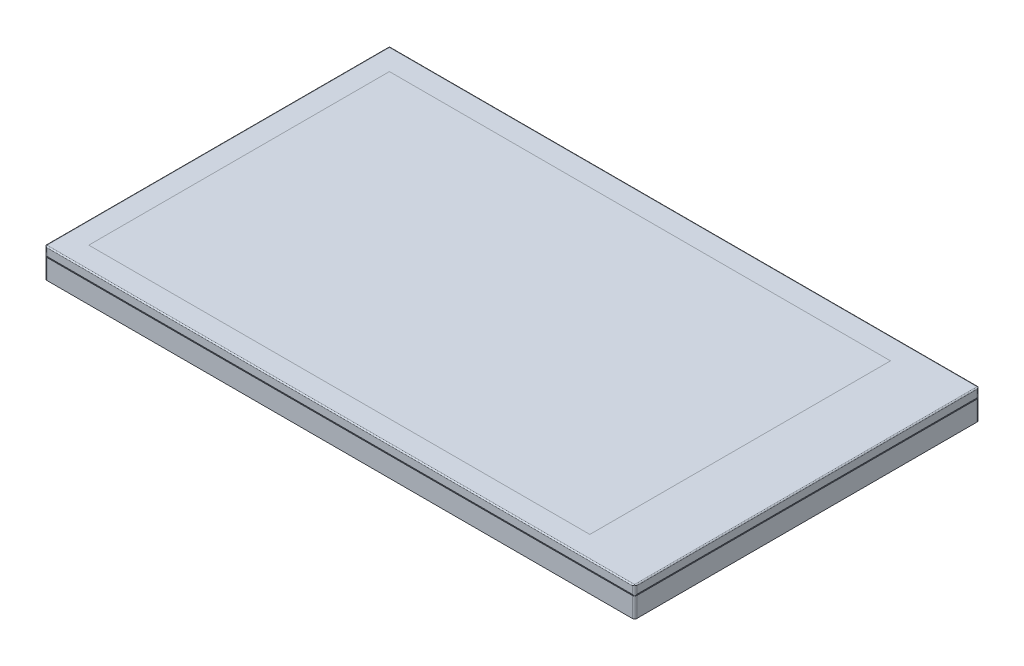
from build123d import *

# Parameters (mm, degrees)
SKETCH1_W              = 77
SKETCH1_H              = 45
SCREEN_BASE_DEPTH      = 3.85
EDGE_FILLET_R          = 0.3
BEZEL_FILLET_ONE_DEPTH = 50
BEZEL_FILLET_TWO_DEPTH = 100


with BuildPart() as part:
    # Sketch1 → Screen Base (new body)
    with BuildSketch(Plane(origin=(0, 0, 0), x_dir=(1, 0, 0), z_dir=(0, 1, 0))):
        Rectangle(SKETCH1_W, SKETCH1_H)
    extrude(amount=SCREEN_BASE_DEPTH)

    # Edge Fillet
    edge_fillet_edges = [part.edges().sort_by_distance(p)[0] for p in [
        (38.5, 1.925, 22.5),
        (-38.5, 1.925, 22.5),
        (-38.5, 1.925, -22.5),
        (38.5, 1.925, -22.5),
    ]]
    fillet(edge_fillet_edges, radius=EDGE_FILLET_R)

    # Sketch6 → Bezel Fillet One (cut, symmetric)
    with BuildSketch(Plane.XY):
        with BuildLine():
            Line((-38.5, 3.85), (-38.5, 3.7))
            ThreePointArc((-38.5, 3.7), (-38.456066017, 3.806066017), (-38.35, 3.85))
            Line((-38.35, 3.85), (-38.5, 3.85))
        make_face()
        with BuildLine():
            Line((38.35, 2.6), (38.5, 2.6))
            Line((38.5, 2.6), (38.5, 2.75))
            ThreePointArc((38.5, 2.75), (38.456066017, 2.643933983), (38.35, 2.6))
        make_face()
        with BuildLine():
            Line((-38.5, 2.6), (-38.5, 2.75))
            ThreePointArc((-38.5, 2.75), (-38.456066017, 2.643933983), (-38.35, 2.6))
            Line((-38.35, 2.6), (-38.5, 2.6))
        make_face()
        with BuildLine():
            Line((38.5, 3.7), (38.5, 3.85))
            Line((38.5, 3.85), (38.35, 3.85))
            ThreePointArc((38.35, 3.85), (38.456066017, 3.806066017), (38.5, 3.7))
        make_face()
    extrude(amount=BEZEL_FILLET_ONE_DEPTH, both=True, mode=Mode.SUBTRACT)

    # Sketch17 → Bezel Fillet Two (cut)
    with BuildSketch(Plane.ZY.offset(38.5)):
        with BuildLine():
            Line((22.35, 2.6), (22.5, 2.6))
            Line((22.5, 2.6), (22.5, 2.75))
            ThreePointArc((22.5, 2.75), (22.456066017, 2.643933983), (22.35, 2.6))
        make_face()
        with BuildLine():
            Line((22.5, 3.85), (22.35, 3.85))
            ThreePointArc((22.35, 3.85), (22.456066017, 3.806066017), (22.5, 3.7))
            Line((22.5, 3.7), (22.5, 3.85))
        make_face()
        with BuildLine():
            Line((-22.5, 2.75), (-22.5, 2.6))
            Line((-22.5, 2.6), (-22.35, 2.6))
            ThreePointArc((-22.35, 2.6), (-22.456066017, 2.643933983), (-22.5, 2.75))
        make_face()
        with BuildLine():
            Line((-22.5, 3.85), (-22.35, 3.85))
            ThreePointArc((-22.35, 3.85), (-22.456066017, 3.806066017), (-22.5, 3.7))
            Line((-22.5, 3.7), (-22.5, 3.85))
        make_face()
    extrude(amount=-BEZEL_FILLET_TWO_DEPTH, mode=Mode.SUBTRACT)


solid = part.part
